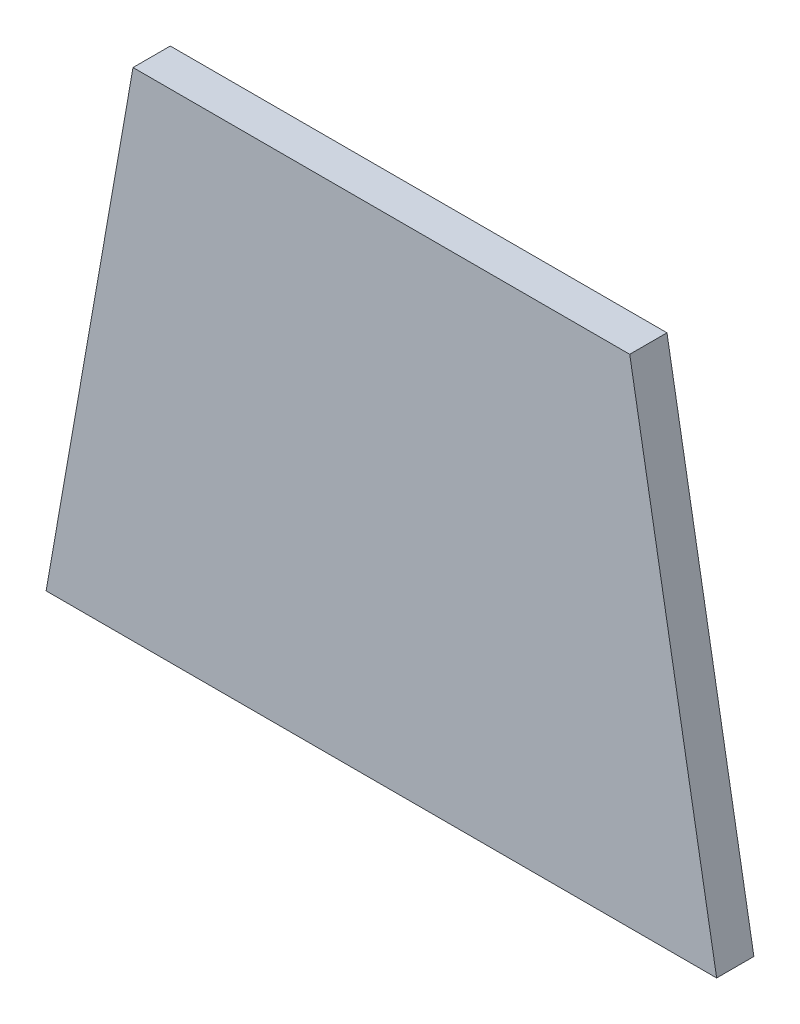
from build123d import *

# Parameters (mm, degrees)
BOSS_EXTRU_1_DEPTH = 15


with BuildPart() as part:
    # Esquisse1 → Boss.-Extru.1 (new body)
    with BuildSketch(Plane.XY):
        Polygon((-135, 0), (135, 0), (100, 200), (-100, 200), align=None)
    extrude(amount=BOSS_EXTRU_1_DEPTH)


solid = part.part
